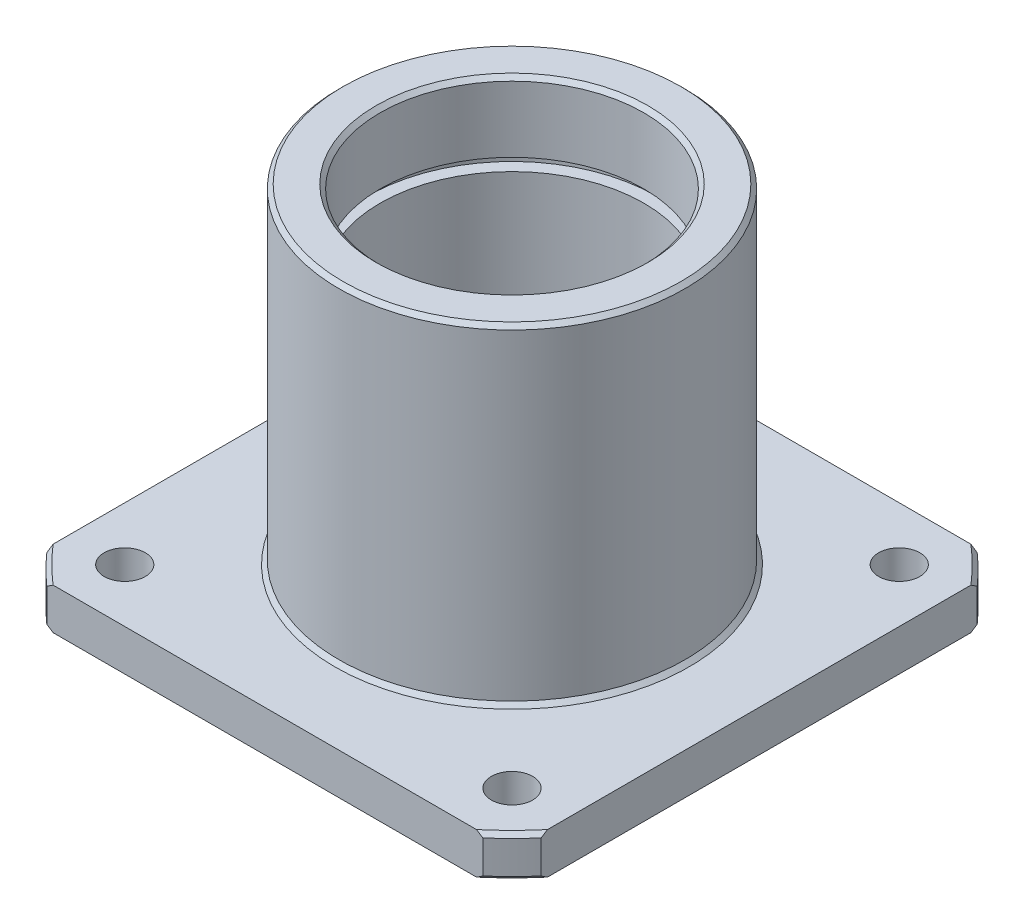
from build123d import *

# Parameters (mm, degrees)
CHAMFER2_SIZE      = 0.5
CUT_EXTRUDE2_REACH = 74.284
SKETCH2_R          = 2.5


with BuildPart() as part:
    # Sketch1 → Revolve1 (revolve)
    with BuildSketch(Plane(origin=(0, 0, 0), x_dir=(0, 0, -1), z_dir=(1, 0, 0)), mode=Mode.PRIVATE) as revolve1_sk:
        Polygon((-21, 44.693704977), (-16, 44.693704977), (-16, 36.193704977), (-17.5, 36.193704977), (-17.5, 34.693704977), (-16, 34.693704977), (-16, -5.306295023), (-24, -5.306295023), (-24, -0.306295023), (-40, -0.306295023), (-40, 4.693704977), (-21, 4.693704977), align=None)
    revolve(revolve1_sk.sketch.rotate(Axis((0, 0, 0), (0, 1, 0)), 180), axis=Axis((0, 0, 0), (0, 1, 0)))

    # Chamfer2
    chamfer2_edges = [part.edges().sort_by_distance(p)[0] for p in [
        (0, -5.306295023, 16),
        (0, -5.306295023, 24),
        (0, -0.306295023, 24),
        (0, -0.306295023, 40),
        (0, 4.693704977, 40),
        (0, 4.693704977, 21),
        (0, 44.693704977, 21),
        (0, 44.693704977, 16),
    ]]
    chamfer(chamfer2_edges, length=CHAMFER2_SIZE)

    # Sketch2 → Cut-Extrude2 (cut, up to next)
    with BuildSketch(Plane.XZ.offset(0.306295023), mode=Mode.PRIVATE) as cut_extrude2_sk1:
        with Locations(Location((23.5, -23.5, 0), (0, 0, 270))):
            Circle(SKETCH2_R)
    cut_extrude2_tool1 = extrude(cut_extrude2_sk1.sketch, amount=-CUT_EXTRUDE2_REACH, mode=Mode.PRIVATE) & part.part
    # Sketch2 → Cut-Extrude2 (cut, up to next)
    with BuildSketch(Plane.XZ.offset(0.306295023), mode=Mode.PRIVATE) as cut_extrude2_sk2:
        with Locations(Location((-23.5, -23.5, 0), (0, 0, 270))):
            Circle(SKETCH2_R)
    cut_extrude2_tool2 = extrude(cut_extrude2_sk2.sketch, amount=-CUT_EXTRUDE2_REACH, mode=Mode.PRIVATE) & part.part
    # Sketch2 → Cut-Extrude2 (cut, up to next)
    with BuildSketch(Plane.XZ.offset(0.306295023), mode=Mode.PRIVATE) as cut_extrude2_sk3:
        with Locations(Location((-23.5, 23.5, 0), (0, 0, 270))):
            Circle(SKETCH2_R)
    cut_extrude2_tool3 = extrude(cut_extrude2_sk3.sketch, amount=-CUT_EXTRUDE2_REACH, mode=Mode.PRIVATE) & part.part
    # Sketch2 → Cut-Extrude2 (cut, up to next)
    with BuildSketch(Plane.XZ.offset(0.306295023), mode=Mode.PRIVATE) as cut_extrude2_sk4:
        with Locations(Location((23.5, 23.5, 0), (0, 0, 270))):
            Circle(SKETCH2_R)
    cut_extrude2_tool4 = extrude(cut_extrude2_sk4.sketch, amount=-CUT_EXTRUDE2_REACH, mode=Mode.PRIVATE) & part.part
    # Sketch2 → Cut-Extrude2 (cut, up to next)
    with BuildSketch(Plane.XZ.offset(0.306295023), mode=Mode.PRIVATE) as cut_extrude2_sk5:
        with BuildLine():
            Line((30, 26.457513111), (30, -26.457513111))
            ThreePointArc((30, -26.457513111), (40, 0), (30, 26.457513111))
        make_face()
    cut_extrude2_tool5 = extrude(cut_extrude2_sk5.sketch, amount=-CUT_EXTRUDE2_REACH, mode=Mode.PRIVATE) & part.part
    # Sketch2 → Cut-Extrude2 (cut, up to next)
    with BuildSketch(Plane.XZ.offset(0.306295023), mode=Mode.PRIVATE) as cut_extrude2_sk6:
        with BuildLine():
            Line((26.457513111, 30), (-26.457513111, 30))
            ThreePointArc((-26.457513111, 30), (0, 40), (26.457513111, 30))
        make_face()
    cut_extrude2_tool6 = extrude(cut_extrude2_sk6.sketch, amount=-CUT_EXTRUDE2_REACH, mode=Mode.PRIVATE) & part.part
    # Sketch2 → Cut-Extrude2 (cut, up to next)
    with BuildSketch(Plane.XZ.offset(0.306295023), mode=Mode.PRIVATE) as cut_extrude2_sk7:
        with BuildLine():
            Line((-30, 26.457513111), (-30, -26.457513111))
            ThreePointArc((-30, -26.457513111), (-40, 0), (-30, 26.457513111))
        make_face()
    cut_extrude2_tool7 = extrude(cut_extrude2_sk7.sketch, amount=-CUT_EXTRUDE2_REACH, mode=Mode.PRIVATE) & part.part
    # Sketch2 → Cut-Extrude2 (cut, up to next)
    with BuildSketch(Plane.XZ.offset(0.306295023), mode=Mode.PRIVATE) as cut_extrude2_sk8:
        with BuildLine():
            Line((26.457513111, -30), (-26.457513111, -30))
            ThreePointArc((-26.457513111, -30), (0, -40), (26.457513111, -30))
        make_face()
    cut_extrude2_tool8 = extrude(cut_extrude2_sk8.sketch, amount=-CUT_EXTRUDE2_REACH, mode=Mode.PRIVATE) & part.part
    add(cut_extrude2_tool1.solids().sort_by_distance((23.5, -0.306295, -23.5))[0], mode=Mode.SUBTRACT)
    add(cut_extrude2_tool2.solids().sort_by_distance((-23.5, -0.306295, -23.5))[0], mode=Mode.SUBTRACT)
    add(cut_extrude2_tool3.solids().sort_by_distance((-23.5, -0.306295, 23.5))[0], mode=Mode.SUBTRACT)
    add(cut_extrude2_tool4.solids().sort_by_distance((23.5, -0.306295, 23.5))[0], mode=Mode.SUBTRACT)
    add(cut_extrude2_tool5.solids().sort_by_distance((34.046215, -0.306295, 0))[0], mode=Mode.SUBTRACT)
    add(cut_extrude2_tool6.solids().sort_by_distance((0, -0.306295, 34.046215))[0], mode=Mode.SUBTRACT)
    add(cut_extrude2_tool7.solids().sort_by_distance((-34.046215, -0.306295, 0))[0], mode=Mode.SUBTRACT)
    add(cut_extrude2_tool8.solids().sort_by_distance((0, -0.306295, -34.046215))[0], mode=Mode.SUBTRACT)


solid = part.part
